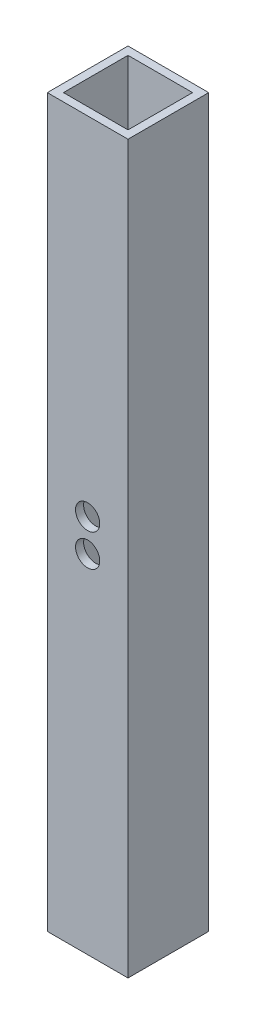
ISO-10303-21;
HEADER;
FILE_DESCRIPTION(('STEP AP214'),'2;1');
FILE_NAME('part.step','',(''),(''),'','','');
FILE_SCHEMA(('AUTOMOTIVE_DESIGN { 1 0 10303 214 1 1 1 1 }'));
ENDSEC;
DATA;
#1=APPLICATION_CONTEXT('core data for automotive mechanical design processes');
#2=APPLICATION_PROTOCOL_DEFINITION('international standard','automotive_design',2000,#1);
#3=PRODUCT_CONTEXT('',#1,'mechanical');
#4=PRODUCT('Part','Part','',(#3));
#5=PRODUCT_RELATED_PRODUCT_CATEGORY('part','',(#4));
#6=PRODUCT_DEFINITION_FORMATION('','',#4);
#7=PRODUCT_DEFINITION_CONTEXT('part definition',#1,'design');
#8=PRODUCT_DEFINITION('design','',#6,#7);
#9=PRODUCT_DEFINITION_SHAPE('','',#8);
#10=(LENGTH_UNIT() NAMED_UNIT(*) SI_UNIT(.MILLI.,.METRE.));
#11=(NAMED_UNIT(*) PLANE_ANGLE_UNIT() SI_UNIT($,.RADIAN.));
#12=(NAMED_UNIT(*) SI_UNIT($,.STERADIAN.) SOLID_ANGLE_UNIT());
#13=UNCERTAINTY_MEASURE_WITH_UNIT(LENGTH_MEASURE(1.E-05),#10,'distance_accuracy_value','');
#14=(GEOMETRIC_REPRESENTATION_CONTEXT(3) GLOBAL_UNCERTAINTY_ASSIGNED_CONTEXT((#13)) GLOBAL_UNIT_ASSIGNED_CONTEXT((#10,
#11,#12)) REPRESENTATION_CONTEXT('',''));
#15=CARTESIAN_POINT('',(0.,0.,0.));
#16=DIRECTION('',(0.,0.,1.));
#17=DIRECTION('',(1.,0.,0.));
#18=AXIS2_PLACEMENT_3D('',#15,#16,#17);
#19=CARTESIAN_POINT('',(0.,90.,0.));
#20=DIRECTION('',(0.,-1.,0.));
#21=DIRECTION('',(0.,0.,-1.));
#22=AXIS2_PLACEMENT_3D('',#19,#20,#21);
#23=PLANE('',#22);
#24=DIRECTION('',(0.,0.,1.));
#25=VECTOR('',#24,1.);
#26=CARTESIAN_POINT('',(0.,90.,0.));
#27=LINE('',#26,#25);
#28=CARTESIAN_POINT('',(0.,90.,-10.));
#29=VERTEX_POINT('',#28);
#30=CARTESIAN_POINT('',(0.,90.,0.));
#31=VERTEX_POINT('',#30);
#32=EDGE_CURVE('E138',#29,#31,#27,.T.);
#33=ORIENTED_EDGE('',*,*,#32,.T.);
#34=DIRECTION('',(1.,0.,0.));
#35=VECTOR('',#34,1.);
#36=CARTESIAN_POINT('',(0.,90.,0.));
#37=LINE('',#36,#35);
#38=CARTESIAN_POINT('',(10.,90.,0.));
#39=VERTEX_POINT('',#38);
#40=EDGE_CURVE('E141',#31,#39,#37,.T.);
#41=ORIENTED_EDGE('',*,*,#40,.T.);
#42=DIRECTION('',(0.,0.,-1.));
#43=VECTOR('',#42,1.);
#44=CARTESIAN_POINT('',(10.,90.,0.));
#45=LINE('',#44,#43);
#46=CARTESIAN_POINT('',(10.,90.,-10.));
#47=VERTEX_POINT('',#46);
#48=EDGE_CURVE('E144',#39,#47,#45,.T.);
#49=ORIENTED_EDGE('',*,*,#48,.T.);
#50=DIRECTION('',(-1.,0.,0.));
#51=VECTOR('',#50,1.);
#52=CARTESIAN_POINT('',(0.,90.,-10.));
#53=LINE('',#52,#51);
#54=EDGE_CURVE('E146',#47,#29,#53,.T.);
#55=ORIENTED_EDGE('',*,*,#54,.T.);
#56=EDGE_LOOP('',(#33,#41,#49,#55));
#57=FACE_BOUND('',#56,.T.);
#58=DIRECTION('',(0.,0.,1.));
#59=VECTOR('',#58,1.);
#60=CARTESIAN_POINT('',(1.,90.,-1.));
#61=LINE('',#60,#59);
#62=CARTESIAN_POINT('',(1.,90.,-9.));
#63=VERTEX_POINT('',#62);
#64=CARTESIAN_POINT('',(1.,90.,-1.));
#65=VERTEX_POINT('',#64);
#66=EDGE_CURVE('E100',#63,#65,#61,.T.);
#67=ORIENTED_EDGE('',*,*,#66,.F.);
#68=DIRECTION('',(-1.,0.,0.));
#69=VECTOR('',#68,1.);
#70=CARTESIAN_POINT('',(1.,90.,-9.));
#71=LINE('',#70,#69);
#72=CARTESIAN_POINT('',(9.,90.,-9.));
#73=VERTEX_POINT('',#72);
#74=EDGE_CURVE('E122',#73,#63,#71,.T.);
#75=ORIENTED_EDGE('',*,*,#74,.F.);
#76=DIRECTION('',(0.,0.,-1.));
#77=VECTOR('',#76,1.);
#78=CARTESIAN_POINT('',(9.,90.,-1.));
#79=LINE('',#78,#77);
#80=CARTESIAN_POINT('',(9.,90.,-1.));
#81=VERTEX_POINT('',#80);
#82=EDGE_CURVE('E120',#81,#73,#79,.T.);
#83=ORIENTED_EDGE('',*,*,#82,.F.);
#84=DIRECTION('',(1.,0.,0.));
#85=VECTOR('',#84,1.);
#86=CARTESIAN_POINT('',(1.,90.,-1.));
#87=LINE('',#86,#85);
#88=EDGE_CURVE('E108',#65,#81,#87,.T.);
#89=ORIENTED_EDGE('',*,*,#88,.F.);
#90=EDGE_LOOP('',(#67,#75,#83,#89));
#91=FACE_BOUND('',#90,.T.);
#92=ADVANCED_FACE('F33',(#57,#91),#23,.F.);
#93=CARTESIAN_POINT('',(0.,0.,0.));
#94=DIRECTION('',(0.,-1.,0.));
#95=DIRECTION('',(0.,0.,-1.));
#96=AXIS2_PLACEMENT_3D('',#93,#94,#95);
#97=PLANE('',#96);
#98=DIRECTION('',(0.,0.,1.));
#99=VECTOR('',#98,1.);
#100=CARTESIAN_POINT('',(0.,0.,0.));
#101=LINE('',#100,#99);
#102=CARTESIAN_POINT('',(0.,0.,-10.));
#103=VERTEX_POINT('',#102);
#104=CARTESIAN_POINT('',(0.,0.,0.));
#105=VERTEX_POINT('',#104);
#106=EDGE_CURVE('E116',#103,#105,#101,.T.);
#107=ORIENTED_EDGE('',*,*,#106,.F.);
#108=DIRECTION('',(-1.,0.,0.));
#109=VECTOR('',#108,1.);
#110=CARTESIAN_POINT('',(0.,0.,-10.));
#111=LINE('',#110,#109);
#112=CARTESIAN_POINT('',(10.,0.,-10.));
#113=VERTEX_POINT('',#112);
#114=EDGE_CURVE('E142',#113,#103,#111,.T.);
#115=ORIENTED_EDGE('',*,*,#114,.F.);
#116=DIRECTION('',(0.,0.,-1.));
#117=VECTOR('',#116,1.);
#118=CARTESIAN_POINT('',(10.,0.,0.));
#119=LINE('',#118,#117);
#120=CARTESIAN_POINT('',(10.,0.,0.));
#121=VERTEX_POINT('',#120);
#122=EDGE_CURVE('E153',#121,#113,#119,.T.);
#123=ORIENTED_EDGE('',*,*,#122,.F.);
#124=DIRECTION('',(1.,0.,0.));
#125=VECTOR('',#124,1.);
#126=CARTESIAN_POINT('',(0.,0.,0.));
#127=LINE('',#126,#125);
#128=EDGE_CURVE('E151',#105,#121,#127,.T.);
#129=ORIENTED_EDGE('',*,*,#128,.F.);
#130=EDGE_LOOP('',(#107,#115,#123,#129));
#131=FACE_BOUND('',#130,.T.);
#132=DIRECTION('',(-1.,0.,0.));
#133=VECTOR('',#132,1.);
#134=CARTESIAN_POINT('',(1.,0.,-9.));
#135=LINE('',#134,#133);
#136=CARTESIAN_POINT('',(9.,0.,-9.));
#137=VERTEX_POINT('',#136);
#138=CARTESIAN_POINT('',(1.,0.,-9.));
#139=VERTEX_POINT('',#138);
#140=EDGE_CURVE('E109',#137,#139,#135,.T.);
#141=ORIENTED_EDGE('',*,*,#140,.T.);
#142=DIRECTION('',(0.,0.,1.));
#143=VECTOR('',#142,1.);
#144=CARTESIAN_POINT('',(1.,0.,-1.));
#145=LINE('',#144,#143);
#146=CARTESIAN_POINT('',(1.,0.,-1.));
#147=VERTEX_POINT('',#146);
#148=EDGE_CURVE('E58',#139,#147,#145,.T.);
#149=ORIENTED_EDGE('',*,*,#148,.T.);
#150=DIRECTION('',(1.,0.,0.));
#151=VECTOR('',#150,1.);
#152=CARTESIAN_POINT('',(1.,0.,-1.));
#153=LINE('',#152,#151);
#154=CARTESIAN_POINT('',(9.,0.,-1.));
#155=VERTEX_POINT('',#154);
#156=EDGE_CURVE('E115',#147,#155,#153,.T.);
#157=ORIENTED_EDGE('',*,*,#156,.T.);
#158=DIRECTION('',(0.,0.,-1.));
#159=VECTOR('',#158,1.);
#160=CARTESIAN_POINT('',(9.,0.,-1.));
#161=LINE('',#160,#159);
#162=EDGE_CURVE('E130',#155,#137,#161,.T.);
#163=ORIENTED_EDGE('',*,*,#162,.T.);
#164=EDGE_LOOP('',(#141,#149,#157,#163));
#165=FACE_BOUND('',#164,.T.);
#166=ADVANCED_FACE('F203',(#131,#165),#97,.T.);
#167=CARTESIAN_POINT('',(0.,90.,0.));
#168=DIRECTION('',(1.,0.,0.));
#169=DIRECTION('',(0.,0.,-1.));
#170=AXIS2_PLACEMENT_3D('',#167,#168,#169);
#171=PLANE('',#170);
#172=ORIENTED_EDGE('',*,*,#106,.T.);
#173=DIRECTION('',(0.,-1.,0.));
#174=VECTOR('',#173,1.);
#175=CARTESIAN_POINT('',(0.,90.,0.));
#176=LINE('',#175,#174);
#177=EDGE_CURVE('E11',#31,#105,#176,.T.);
#178=ORIENTED_EDGE('',*,*,#177,.F.);
#179=ORIENTED_EDGE('',*,*,#32,.F.);
#180=DIRECTION('',(0.,-1.,0.));
#181=VECTOR('',#180,1.);
#182=CARTESIAN_POINT('',(0.,90.,-10.));
#183=LINE('',#182,#181);
#184=EDGE_CURVE('E148',#29,#103,#183,.T.);
#185=ORIENTED_EDGE('',*,*,#184,.T.);
#186=EDGE_LOOP('',(#172,#178,#179,#185));
#187=FACE_BOUND('',#186,.T.);
#188=ADVANCED_FACE('F35',(#187),#171,.F.);
#189=CARTESIAN_POINT('',(0.,90.,0.));
#190=DIRECTION('',(0.,0.,-1.));
#191=DIRECTION('',(-1.,0.,0.));
#192=AXIS2_PLACEMENT_3D('',#189,#190,#191);
#193=PLANE('',#192);
#194=CARTESIAN_POINT('',(5.,43.,0.));
#195=DIRECTION('',(0.,0.,1.));
#196=DIRECTION('',(1.,0.,0.));
#197=AXIS2_PLACEMENT_3D('',#194,#195,#196);
#198=CIRCLE('',#197,1.5);
#199=CARTESIAN_POINT('',(6.5,43.,0.));
#200=VERTEX_POINT('',#199);
#201=EDGE_CURVE('E182',#200,#200,#198,.T.);
#202=ORIENTED_EDGE('',*,*,#201,.F.);
#203=EDGE_LOOP('',(#202));
#204=FACE_BOUND('',#203,.T.);
#205=CARTESIAN_POINT('',(5.,47.,0.));
#206=DIRECTION('',(0.,0.,1.));
#207=DIRECTION('',(1.,0.,0.));
#208=AXIS2_PLACEMENT_3D('',#205,#206,#207);
#209=CIRCLE('',#208,1.5);
#210=CARTESIAN_POINT('',(6.5,47.,0.));
#211=VERTEX_POINT('',#210);
#212=EDGE_CURVE('E169',#211,#211,#209,.T.);
#213=ORIENTED_EDGE('',*,*,#212,.F.);
#214=EDGE_LOOP('',(#213));
#215=FACE_BOUND('',#214,.T.);
#216=ORIENTED_EDGE('',*,*,#128,.T.);
#217=DIRECTION('',(0.,-1.,0.));
#218=VECTOR('',#217,1.);
#219=CARTESIAN_POINT('',(10.,90.,0.));
#220=LINE('',#219,#218);
#221=EDGE_CURVE('E42',#39,#121,#220,.T.);
#222=ORIENTED_EDGE('',*,*,#221,.F.);
#223=ORIENTED_EDGE('',*,*,#40,.F.);
#224=ORIENTED_EDGE('',*,*,#177,.T.);
#225=EDGE_LOOP('',(#216,#222,#223,#224));
#226=FACE_BOUND('',#225,.T.);
#227=ADVANCED_FACE('F188',(#204,#215,#226),#193,.F.);
#228=CARTESIAN_POINT('',(10.,90.,0.));
#229=DIRECTION('',(-1.,0.,0.));
#230=DIRECTION('',(0.,0.,1.));
#231=AXIS2_PLACEMENT_3D('',#228,#229,#230);
#232=PLANE('',#231);
#233=ORIENTED_EDGE('',*,*,#122,.T.);
#234=DIRECTION('',(0.,-1.,0.));
#235=VECTOR('',#234,1.);
#236=CARTESIAN_POINT('',(10.,90.,-10.));
#237=LINE('',#236,#235);
#238=EDGE_CURVE('E158',#47,#113,#237,.T.);
#239=ORIENTED_EDGE('',*,*,#238,.F.);
#240=ORIENTED_EDGE('',*,*,#48,.F.);
#241=ORIENTED_EDGE('',*,*,#221,.T.);
#242=EDGE_LOOP('',(#233,#239,#240,#241));
#243=FACE_BOUND('',#242,.T.);
#244=ADVANCED_FACE('F191',(#243),#232,.F.);
#245=CARTESIAN_POINT('',(0.,90.,-10.));
#246=DIRECTION('',(0.,0.,1.));
#247=DIRECTION('',(1.,0.,0.));
#248=AXIS2_PLACEMENT_3D('',#245,#246,#247);
#249=PLANE('',#248);
#250=CARTESIAN_POINT('',(5.,43.,-10.));
#251=DIRECTION('',(0.,0.,1.));
#252=DIRECTION('',(1.,0.,0.));
#253=AXIS2_PLACEMENT_3D('',#250,#251,#252);
#254=CIRCLE('',#253,1.5);
#255=CARTESIAN_POINT('',(6.5,43.,-10.));
#256=VERTEX_POINT('',#255);
#257=EDGE_CURVE('E179',#256,#256,#254,.F.);
#258=ORIENTED_EDGE('',*,*,#257,.F.);
#259=EDGE_LOOP('',(#258));
#260=FACE_BOUND('',#259,.T.);
#261=CARTESIAN_POINT('',(5.,47.,-10.));
#262=DIRECTION('',(0.,0.,1.));
#263=DIRECTION('',(1.,0.,0.));
#264=AXIS2_PLACEMENT_3D('',#261,#262,#263);
#265=CIRCLE('',#264,1.5);
#266=CARTESIAN_POINT('',(6.5,47.,-10.));
#267=VERTEX_POINT('',#266);
#268=EDGE_CURVE('E164',#267,#267,#265,.F.);
#269=ORIENTED_EDGE('',*,*,#268,.F.);
#270=EDGE_LOOP('',(#269));
#271=FACE_BOUND('',#270,.T.);
#272=ORIENTED_EDGE('',*,*,#114,.T.);
#273=ORIENTED_EDGE('',*,*,#184,.F.);
#274=ORIENTED_EDGE('',*,*,#54,.F.);
#275=ORIENTED_EDGE('',*,*,#238,.T.);
#276=EDGE_LOOP('',(#272,#273,#274,#275));
#277=FACE_BOUND('',#276,.T.);
#278=ADVANCED_FACE('F207',(#260,#271,#277),#249,.F.);
#279=CARTESIAN_POINT('',(1.,90.,-1.));
#280=DIRECTION('',(1.,0.,0.));
#281=DIRECTION('',(0.,0.,-1.));
#282=AXIS2_PLACEMENT_3D('',#279,#280,#281);
#283=PLANE('',#282);
#284=ORIENTED_EDGE('',*,*,#148,.F.);
#285=DIRECTION('',(0.,-1.,0.));
#286=VECTOR('',#285,1.);
#287=CARTESIAN_POINT('',(1.,90.,-9.));
#288=LINE('',#287,#286);
#289=EDGE_CURVE('E104',#63,#139,#288,.T.);
#290=ORIENTED_EDGE('',*,*,#289,.F.);
#291=ORIENTED_EDGE('',*,*,#66,.T.);
#292=DIRECTION('',(0.,-1.,0.));
#293=VECTOR('',#292,1.);
#294=CARTESIAN_POINT('',(1.,90.,-1.));
#295=LINE('',#294,#293);
#296=EDGE_CURVE('E103',#65,#147,#295,.T.);
#297=ORIENTED_EDGE('',*,*,#296,.T.);
#298=EDGE_LOOP('',(#284,#290,#291,#297));
#299=FACE_BOUND('',#298,.T.);
#300=ADVANCED_FACE('F102',(#299),#283,.T.);
#301=CARTESIAN_POINT('',(1.,90.,-1.));
#302=DIRECTION('',(0.,0.,-1.));
#303=DIRECTION('',(-1.,0.,0.));
#304=AXIS2_PLACEMENT_3D('',#301,#302,#303);
#305=PLANE('',#304);
#306=CARTESIAN_POINT('',(5.,43.,-0.999999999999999));
#307=DIRECTION('',(0.,0.,-1.));
#308=DIRECTION('',(-1.,0.,0.));
#309=AXIS2_PLACEMENT_3D('',#306,#307,#308);
#310=CIRCLE('',#309,1.5);
#311=CARTESIAN_POINT('',(6.5,43.,-0.999999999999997));
#312=VERTEX_POINT('',#311);
#313=EDGE_CURVE('E174',#312,#312,#310,.T.);
#314=ORIENTED_EDGE('',*,*,#313,.F.);
#315=EDGE_LOOP('',(#314));
#316=FACE_BOUND('',#315,.T.);
#317=CARTESIAN_POINT('',(5.,47.,-0.999999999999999));
#318=DIRECTION('',(0.,0.,-1.));
#319=DIRECTION('',(-1.,0.,0.));
#320=AXIS2_PLACEMENT_3D('',#317,#318,#319);
#321=CIRCLE('',#320,1.5);
#322=CARTESIAN_POINT('',(6.5,47.,-0.999999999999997));
#323=VERTEX_POINT('',#322);
#324=EDGE_CURVE('E128',#323,#323,#321,.T.);
#325=ORIENTED_EDGE('',*,*,#324,.F.);
#326=EDGE_LOOP('',(#325));
#327=FACE_BOUND('',#326,.T.);
#328=ORIENTED_EDGE('',*,*,#156,.F.);
#329=ORIENTED_EDGE('',*,*,#296,.F.);
#330=ORIENTED_EDGE('',*,*,#88,.T.);
#331=DIRECTION('',(0.,-1.,0.));
#332=VECTOR('',#331,1.);
#333=CARTESIAN_POINT('',(9.,90.,-1.));
#334=LINE('',#333,#332);
#335=EDGE_CURVE('E117',#81,#155,#334,.T.);
#336=ORIENTED_EDGE('',*,*,#335,.T.);
#337=EDGE_LOOP('',(#328,#329,#330,#336));
#338=FACE_BOUND('',#337,.T.);
#339=ADVANCED_FACE('F112',(#316,#327,#338),#305,.T.);
#340=CARTESIAN_POINT('',(9.,90.,-1.));
#341=DIRECTION('',(-1.,0.,0.));
#342=DIRECTION('',(0.,0.,1.));
#343=AXIS2_PLACEMENT_3D('',#340,#341,#342);
#344=PLANE('',#343);
#345=ORIENTED_EDGE('',*,*,#162,.F.);
#346=ORIENTED_EDGE('',*,*,#335,.F.);
#347=ORIENTED_EDGE('',*,*,#82,.T.);
#348=DIRECTION('',(0.,-1.,0.));
#349=VECTOR('',#348,1.);
#350=CARTESIAN_POINT('',(9.,90.,-9.));
#351=LINE('',#350,#349);
#352=EDGE_CURVE('E50',#73,#137,#351,.T.);
#353=ORIENTED_EDGE('',*,*,#352,.T.);
#354=EDGE_LOOP('',(#345,#346,#347,#353));
#355=FACE_BOUND('',#354,.T.);
#356=ADVANCED_FACE('F251',(#355),#344,.T.);
#357=CARTESIAN_POINT('',(1.,90.,-9.));
#358=DIRECTION('',(0.,0.,1.));
#359=DIRECTION('',(1.,0.,0.));
#360=AXIS2_PLACEMENT_3D('',#357,#358,#359);
#361=PLANE('',#360);
#362=CARTESIAN_POINT('',(5.,43.,-9.));
#363=DIRECTION('',(0.,0.,1.));
#364=DIRECTION('',(1.,0.,0.));
#365=AXIS2_PLACEMENT_3D('',#362,#363,#364);
#366=CIRCLE('',#365,1.5);
#367=CARTESIAN_POINT('',(6.5,43.,-9.));
#368=VERTEX_POINT('',#367);
#369=EDGE_CURVE('E37',#368,#368,#366,.T.);
#370=ORIENTED_EDGE('',*,*,#369,.F.);
#371=EDGE_LOOP('',(#370));
#372=FACE_BOUND('',#371,.T.);
#373=CARTESIAN_POINT('',(5.,47.,-9.));
#374=DIRECTION('',(0.,0.,1.));
#375=DIRECTION('',(1.,0.,0.));
#376=AXIS2_PLACEMENT_3D('',#373,#374,#375);
#377=CIRCLE('',#376,1.5);
#378=CARTESIAN_POINT('',(6.5,47.,-9.));
#379=VERTEX_POINT('',#378);
#380=EDGE_CURVE('E162',#379,#379,#377,.T.);
#381=ORIENTED_EDGE('',*,*,#380,.F.);
#382=EDGE_LOOP('',(#381));
#383=FACE_BOUND('',#382,.T.);
#384=ORIENTED_EDGE('',*,*,#140,.F.);
#385=ORIENTED_EDGE('',*,*,#352,.F.);
#386=ORIENTED_EDGE('',*,*,#74,.T.);
#387=ORIENTED_EDGE('',*,*,#289,.T.);
#388=EDGE_LOOP('',(#384,#385,#386,#387));
#389=FACE_BOUND('',#388,.T.);
#390=ADVANCED_FACE('F260',(#372,#383,#389),#361,.T.);
#391=CARTESIAN_POINT('',(5.,47.,-14.2426406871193));
#392=DIRECTION('',(0.,0.,1.));
#393=DIRECTION('',(1.,0.,0.));
#394=AXIS2_PLACEMENT_3D('',#391,#392,#393);
#395=CYLINDRICAL_SURFACE('',#394,1.5);
#396=CARTESIAN_POINT('',(6.5,47.,-9.));
#397=CARTESIAN_POINT('',(6.5,47.,-9.01041666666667));
#398=CARTESIAN_POINT('',(6.5,47.,-9.02083333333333));
#399=CARTESIAN_POINT('',(6.5,47.,-9.04166666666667));
#400=CARTESIAN_POINT('',(6.5,47.,-9.05208333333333));
#401=CARTESIAN_POINT('',(6.5,47.,-9.07291666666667));
#402=CARTESIAN_POINT('',(6.5,47.,-9.08333333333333));
#403=CARTESIAN_POINT('',(6.5,47.,-9.10416666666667));
#404=CARTESIAN_POINT('',(6.5,47.,-9.11458333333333));
#405=CARTESIAN_POINT('',(6.5,47.,-9.13541666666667));
#406=CARTESIAN_POINT('',(6.5,47.,-9.14583333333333));
#407=CARTESIAN_POINT('',(6.5,47.,-9.16666666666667));
#408=CARTESIAN_POINT('',(6.5,47.,-9.17708333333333));
#409=CARTESIAN_POINT('',(6.5,47.,-9.19791666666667));
#410=CARTESIAN_POINT('',(6.5,47.,-9.20833333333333));
#411=CARTESIAN_POINT('',(6.5,47.,-9.22916666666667));
#412=CARTESIAN_POINT('',(6.5,47.,-9.23958333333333));
#413=CARTESIAN_POINT('',(6.5,47.,-9.26041666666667));
#414=CARTESIAN_POINT('',(6.5,47.,-9.27083333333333));
#415=CARTESIAN_POINT('',(6.5,47.,-9.29166666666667));
#416=CARTESIAN_POINT('',(6.5,47.,-9.30208333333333));
#417=CARTESIAN_POINT('',(6.5,47.,-9.32291666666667));
#418=CARTESIAN_POINT('',(6.5,47.,-9.33333333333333));
#419=CARTESIAN_POINT('',(6.5,47.,-9.35416666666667));
#420=CARTESIAN_POINT('',(6.5,47.,-9.36458333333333));
#421=CARTESIAN_POINT('',(6.5,47.,-9.38541666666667));
#422=CARTESIAN_POINT('',(6.5,47.,-9.39583333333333));
#423=CARTESIAN_POINT('',(6.5,47.,-9.41666666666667));
#424=CARTESIAN_POINT('',(6.5,47.,-9.42708333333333));
#425=CARTESIAN_POINT('',(6.5,47.,-9.44791666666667));
#426=CARTESIAN_POINT('',(6.5,47.,-9.45833333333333));
#427=CARTESIAN_POINT('',(6.5,47.,-9.47916666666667));
#428=CARTESIAN_POINT('',(6.5,47.,-9.48958333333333));
#429=CARTESIAN_POINT('',(6.5,47.,-9.51041666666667));
#430=CARTESIAN_POINT('',(6.5,47.,-9.52083333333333));
#431=CARTESIAN_POINT('',(6.5,47.,-9.54166666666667));
#432=CARTESIAN_POINT('',(6.5,47.,-9.55208333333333));
#433=CARTESIAN_POINT('',(6.5,47.,-9.57291666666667));
#434=CARTESIAN_POINT('',(6.5,47.,-9.58333333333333));
#435=CARTESIAN_POINT('',(6.5,47.,-9.60416666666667));
#436=CARTESIAN_POINT('',(6.5,47.,-9.61458333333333));
#437=CARTESIAN_POINT('',(6.5,47.,-9.63541666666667));
#438=CARTESIAN_POINT('',(6.5,47.,-9.64583333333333));
#439=CARTESIAN_POINT('',(6.5,47.,-9.66666666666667));
#440=CARTESIAN_POINT('',(6.5,47.,-9.67708333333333));
#441=CARTESIAN_POINT('',(6.5,47.,-9.69791666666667));
#442=CARTESIAN_POINT('',(6.5,47.,-9.70833333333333));
#443=CARTESIAN_POINT('',(6.5,47.,-9.72916666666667));
#444=CARTESIAN_POINT('',(6.5,47.,-9.73958333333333));
#445=CARTESIAN_POINT('',(6.5,47.,-9.76041666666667));
#446=CARTESIAN_POINT('',(6.5,47.,-9.77083333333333));
#447=CARTESIAN_POINT('',(6.5,47.,-9.79166666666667));
#448=CARTESIAN_POINT('',(6.5,47.,-9.80208333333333));
#449=CARTESIAN_POINT('',(6.5,47.,-9.82291666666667));
#450=CARTESIAN_POINT('',(6.5,47.,-9.83333333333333));
#451=CARTESIAN_POINT('',(6.5,47.,-9.85416666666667));
#452=CARTESIAN_POINT('',(6.5,47.,-9.86458333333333));
#453=CARTESIAN_POINT('',(6.5,47.,-9.88541666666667));
#454=CARTESIAN_POINT('',(6.5,47.,-9.89583333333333));
#455=CARTESIAN_POINT('',(6.5,47.,-9.91666666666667));
#456=CARTESIAN_POINT('',(6.5,47.,-9.92708333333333));
#457=CARTESIAN_POINT('',(6.5,47.,-9.94791666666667));
#458=CARTESIAN_POINT('',(6.5,47.,-9.95833333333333));
#459=CARTESIAN_POINT('',(6.5,47.,-9.97916666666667));
#460=CARTESIAN_POINT('',(6.5,47.,-9.98958333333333));
#461=CARTESIAN_POINT('',(6.5,47.,-10.));
#462=B_SPLINE_CURVE_WITH_KNOTS('',3,(#396,#397,#398,#399,#400,#401,#402,#403,#404,#405,#406,
#407,#408,#409,#410,#411,#412,#413,#414,#415,#416,#417,#418,#419,#420,#421,#422,#423,#424,#425,
#426,#427,#428,#429,#430,#431,#432,#433,#434,#435,#436,#437,#438,#439,#440,#441,#442,#443,#444,
#445,#446,#447,#448,#449,#450,#451,#452,#453,#454,#455,#456,#457,#458,#459,#460,#461),
.UNSPECIFIED.,.F.,.F.,(4,2,2,2,2,2,2,2,2,2,2,2,2,2,2,2,2,2,2,2,2,2,2,2,2,2,2,2,2,2,2,2,4),(0.,
0.03125,0.0625000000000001,0.0937500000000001,0.125,0.15625,0.1875,0.21875,0.25,0.28125,0.3125,
0.34375,0.375,0.40625,0.4375,0.46875,0.5,0.53125,0.5625,0.593750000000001,0.625000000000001,
0.656250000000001,0.687500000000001,0.718750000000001,0.750000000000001,0.781250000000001,
0.812500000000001,0.843750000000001,0.875000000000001,0.906250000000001,0.937500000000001,
0.968750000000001,1.),.UNSPECIFIED.);
#463=EDGE_CURVE('BSEAM267',#379,#267,#462,.T.);
#464=ORIENTED_EDGE('',*,*,#380,.T.);
#465=ORIENTED_EDGE('',*,*,#268,.T.);
#466=ORIENTED_EDGE('',*,*,#463,.T.);
#467=ORIENTED_EDGE('',*,*,#463,.F.);
#468=EDGE_LOOP('',(#464,#466,#465,#467));
#469=FACE_BOUND('',#468,.T.);
#470=ADVANCED_FACE('F267',(#469),#395,.F.);
#471=CARTESIAN_POINT('',(6.5,47.,-0.999999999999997));
#472=CARTESIAN_POINT('',(6.5,47.,-0.989583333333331));
#473=CARTESIAN_POINT('',(6.5,47.,-0.979166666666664));
#474=CARTESIAN_POINT('',(6.5,47.,-0.958333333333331));
#475=CARTESIAN_POINT('',(6.5,47.,-0.947916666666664));
#476=CARTESIAN_POINT('',(6.5,47.,-0.927083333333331));
#477=CARTESIAN_POINT('',(6.5,47.,-0.916666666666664));
#478=CARTESIAN_POINT('',(6.5,47.,-0.895833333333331));
#479=CARTESIAN_POINT('',(6.5,47.,-0.885416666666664));
#480=CARTESIAN_POINT('',(6.5,47.,-0.864583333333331));
#481=CARTESIAN_POINT('',(6.5,47.,-0.854166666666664));
#482=CARTESIAN_POINT('',(6.5,47.,-0.833333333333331));
#483=CARTESIAN_POINT('',(6.5,47.,-0.822916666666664));
#484=CARTESIAN_POINT('',(6.5,47.,-0.802083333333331));
#485=CARTESIAN_POINT('',(6.5,47.,-0.791666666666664));
#486=CARTESIAN_POINT('',(6.5,47.,-0.77083333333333));
#487=CARTESIAN_POINT('',(6.5,47.,-0.760416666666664));
#488=CARTESIAN_POINT('',(6.5,47.,-0.739583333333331));
#489=CARTESIAN_POINT('',(6.5,47.,-0.729166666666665));
#490=CARTESIAN_POINT('',(6.5,47.,-0.708333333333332));
#491=CARTESIAN_POINT('',(6.5,47.,-0.697916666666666));
#492=CARTESIAN_POINT('',(6.5,47.,-0.677083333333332));
#493=CARTESIAN_POINT('',(6.5,47.,-0.666666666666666));
#494=CARTESIAN_POINT('',(6.5,47.,-0.645833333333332));
#495=CARTESIAN_POINT('',(6.5,47.,-0.635416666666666));
#496=CARTESIAN_POINT('',(6.5,47.,-0.614583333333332));
#497=CARTESIAN_POINT('',(6.5,47.,-0.604166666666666));
#498=CARTESIAN_POINT('',(6.5,47.,-0.583333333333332));
#499=CARTESIAN_POINT('',(6.5,47.,-0.572916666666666));
#500=CARTESIAN_POINT('',(6.5,47.,-0.552083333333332));
#501=CARTESIAN_POINT('',(6.5,47.,-0.541666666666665));
#502=CARTESIAN_POINT('',(6.5,47.,-0.520833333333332));
#503=CARTESIAN_POINT('',(6.5,47.,-0.510416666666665));
#504=CARTESIAN_POINT('',(6.5,47.,-0.489583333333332));
#505=CARTESIAN_POINT('',(6.5,47.,-0.479166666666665));
#506=CARTESIAN_POINT('',(6.5,47.,-0.458333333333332));
#507=CARTESIAN_POINT('',(6.5,47.,-0.447916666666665));
#508=CARTESIAN_POINT('',(6.5,47.,-0.427083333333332));
#509=CARTESIAN_POINT('',(6.5,47.,-0.416666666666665));
#510=CARTESIAN_POINT('',(6.5,47.,-0.395833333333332));
#511=CARTESIAN_POINT('',(6.5,47.,-0.385416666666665));
#512=CARTESIAN_POINT('',(6.5,47.,-0.364583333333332));
#513=CARTESIAN_POINT('',(6.5,47.,-0.354166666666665));
#514=CARTESIAN_POINT('',(6.5,47.,-0.333333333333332));
#515=CARTESIAN_POINT('',(6.5,47.,-0.322916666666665));
#516=CARTESIAN_POINT('',(6.5,47.,-0.302083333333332));
#517=CARTESIAN_POINT('',(6.5,47.,-0.291666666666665));
#518=CARTESIAN_POINT('',(6.5,47.,-0.270833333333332));
#519=CARTESIAN_POINT('',(6.5,47.,-0.260416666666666));
#520=CARTESIAN_POINT('',(6.5,47.,-0.239583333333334));
#521=CARTESIAN_POINT('',(6.5,47.,-0.229166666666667));
#522=CARTESIAN_POINT('',(6.5,47.,-0.208333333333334));
#523=CARTESIAN_POINT('',(6.5,47.,-0.197916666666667));
#524=CARTESIAN_POINT('',(6.5,47.,-0.177083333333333));
#525=CARTESIAN_POINT('',(6.5,47.,-0.166666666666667));
#526=CARTESIAN_POINT('',(6.5,47.,-0.145833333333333));
#527=CARTESIAN_POINT('',(6.5,47.,-0.135416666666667));
#528=CARTESIAN_POINT('',(6.5,47.,-0.114583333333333));
#529=CARTESIAN_POINT('',(6.5,47.,-0.104166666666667));
#530=CARTESIAN_POINT('',(6.5,47.,-0.0833333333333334));
#531=CARTESIAN_POINT('',(6.5,47.,-0.0729166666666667));
#532=CARTESIAN_POINT('',(6.5,47.,-0.0520833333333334));
#533=CARTESIAN_POINT('',(6.5,47.,-0.0416666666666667));
#534=CARTESIAN_POINT('',(6.5,47.,-0.0208333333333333));
#535=CARTESIAN_POINT('',(6.5,47.,-0.0104166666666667));
#536=CARTESIAN_POINT('',(6.5,47.,0.));
#537=B_SPLINE_CURVE_WITH_KNOTS('',3,(#471,#472,#473,#474,#475,#476,#477,#478,#479,#480,#481,
#482,#483,#484,#485,#486,#487,#488,#489,#490,#491,#492,#493,#494,#495,#496,#497,#498,#499,#500,
#501,#502,#503,#504,#505,#506,#507,#508,#509,#510,#511,#512,#513,#514,#515,#516,#517,#518,#519,
#520,#521,#522,#523,#524,#525,#526,#527,#528,#529,#530,#531,#532,#533,#534,#535,#536),
.UNSPECIFIED.,.F.,.F.,(4,2,2,2,2,2,2,2,2,2,2,2,2,2,2,2,2,2,2,2,2,2,2,2,2,2,2,2,2,2,2,2,4),(0.,
0.03125,0.0625000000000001,0.0937500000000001,0.125,0.15625,0.1875,0.21875,0.25,
0.281249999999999,0.312499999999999,0.343749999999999,0.374999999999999,0.406249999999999,
0.437499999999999,0.468749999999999,0.499999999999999,0.531249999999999,0.562499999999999,
0.593749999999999,0.624999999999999,0.656249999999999,0.687499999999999,0.718749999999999,
0.749999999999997,0.781249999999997,0.812499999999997,0.843749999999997,0.874999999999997,
0.906249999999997,0.937499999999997,0.968749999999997,0.999999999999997),.UNSPECIFIED.);
#538=EDGE_CURVE('BSEAM277',#323,#211,#537,.T.);
#539=ORIENTED_EDGE('',*,*,#324,.T.);
#540=ORIENTED_EDGE('',*,*,#212,.T.);
#541=ORIENTED_EDGE('',*,*,#538,.T.);
#542=ORIENTED_EDGE('',*,*,#538,.F.);
#543=EDGE_LOOP('',(#539,#541,#540,#542));
#544=FACE_BOUND('',#543,.T.);
#545=ADVANCED_FACE('F277',(#544),#395,.F.);
#546=CARTESIAN_POINT('',(5.,43.,-14.2426406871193));
#547=DIRECTION('',(0.,0.,1.));
#548=DIRECTION('',(1.,0.,0.));
#549=AXIS2_PLACEMENT_3D('',#546,#547,#548);
#550=CYLINDRICAL_SURFACE('',#549,1.5);
#551=CARTESIAN_POINT('',(6.5,43.,-9.));
#552=CARTESIAN_POINT('',(6.5,43.,-9.01041666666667));
#553=CARTESIAN_POINT('',(6.5,43.,-9.02083333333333));
#554=CARTESIAN_POINT('',(6.5,43.,-9.04166666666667));
#555=CARTESIAN_POINT('',(6.5,43.,-9.05208333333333));
#556=CARTESIAN_POINT('',(6.5,43.,-9.07291666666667));
#557=CARTESIAN_POINT('',(6.5,43.,-9.08333333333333));
#558=CARTESIAN_POINT('',(6.5,43.,-9.10416666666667));
#559=CARTESIAN_POINT('',(6.5,43.,-9.11458333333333));
#560=CARTESIAN_POINT('',(6.5,43.,-9.13541666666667));
#561=CARTESIAN_POINT('',(6.5,43.,-9.14583333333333));
#562=CARTESIAN_POINT('',(6.5,43.,-9.16666666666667));
#563=CARTESIAN_POINT('',(6.5,43.,-9.17708333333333));
#564=CARTESIAN_POINT('',(6.5,43.,-9.19791666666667));
#565=CARTESIAN_POINT('',(6.5,43.,-9.20833333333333));
#566=CARTESIAN_POINT('',(6.5,43.,-9.22916666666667));
#567=CARTESIAN_POINT('',(6.5,43.,-9.23958333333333));
#568=CARTESIAN_POINT('',(6.5,43.,-9.26041666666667));
#569=CARTESIAN_POINT('',(6.5,43.,-9.27083333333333));
#570=CARTESIAN_POINT('',(6.5,43.,-9.29166666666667));
#571=CARTESIAN_POINT('',(6.5,43.,-9.30208333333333));
#572=CARTESIAN_POINT('',(6.5,43.,-9.32291666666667));
#573=CARTESIAN_POINT('',(6.5,43.,-9.33333333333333));
#574=CARTESIAN_POINT('',(6.5,43.,-9.35416666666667));
#575=CARTESIAN_POINT('',(6.5,43.,-9.36458333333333));
#576=CARTESIAN_POINT('',(6.5,43.,-9.38541666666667));
#577=CARTESIAN_POINT('',(6.5,43.,-9.39583333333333));
#578=CARTESIAN_POINT('',(6.5,43.,-9.41666666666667));
#579=CARTESIAN_POINT('',(6.5,43.,-9.42708333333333));
#580=CARTESIAN_POINT('',(6.5,43.,-9.44791666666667));
#581=CARTESIAN_POINT('',(6.5,43.,-9.45833333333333));
#582=CARTESIAN_POINT('',(6.5,43.,-9.47916666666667));
#583=CARTESIAN_POINT('',(6.5,43.,-9.48958333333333));
#584=CARTESIAN_POINT('',(6.5,43.,-9.51041666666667));
#585=CARTESIAN_POINT('',(6.5,43.,-9.52083333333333));
#586=CARTESIAN_POINT('',(6.5,43.,-9.54166666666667));
#587=CARTESIAN_POINT('',(6.5,43.,-9.55208333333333));
#588=CARTESIAN_POINT('',(6.5,43.,-9.57291666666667));
#589=CARTESIAN_POINT('',(6.5,43.,-9.58333333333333));
#590=CARTESIAN_POINT('',(6.5,43.,-9.60416666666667));
#591=CARTESIAN_POINT('',(6.5,43.,-9.61458333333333));
#592=CARTESIAN_POINT('',(6.5,43.,-9.63541666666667));
#593=CARTESIAN_POINT('',(6.5,43.,-9.64583333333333));
#594=CARTESIAN_POINT('',(6.5,43.,-9.66666666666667));
#595=CARTESIAN_POINT('',(6.5,43.,-9.67708333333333));
#596=CARTESIAN_POINT('',(6.5,43.,-9.69791666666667));
#597=CARTESIAN_POINT('',(6.5,43.,-9.70833333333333));
#598=CARTESIAN_POINT('',(6.5,43.,-9.72916666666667));
#599=CARTESIAN_POINT('',(6.5,43.,-9.73958333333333));
#600=CARTESIAN_POINT('',(6.5,43.,-9.76041666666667));
#601=CARTESIAN_POINT('',(6.5,43.,-9.77083333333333));
#602=CARTESIAN_POINT('',(6.5,43.,-9.79166666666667));
#603=CARTESIAN_POINT('',(6.5,43.,-9.80208333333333));
#604=CARTESIAN_POINT('',(6.5,43.,-9.82291666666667));
#605=CARTESIAN_POINT('',(6.5,43.,-9.83333333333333));
#606=CARTESIAN_POINT('',(6.5,43.,-9.85416666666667));
#607=CARTESIAN_POINT('',(6.5,43.,-9.86458333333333));
#608=CARTESIAN_POINT('',(6.5,43.,-9.88541666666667));
#609=CARTESIAN_POINT('',(6.5,43.,-9.89583333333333));
#610=CARTESIAN_POINT('',(6.5,43.,-9.91666666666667));
#611=CARTESIAN_POINT('',(6.5,43.,-9.92708333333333));
#612=CARTESIAN_POINT('',(6.5,43.,-9.94791666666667));
#613=CARTESIAN_POINT('',(6.5,43.,-9.95833333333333));
#614=CARTESIAN_POINT('',(6.5,43.,-9.97916666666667));
#615=CARTESIAN_POINT('',(6.5,43.,-9.98958333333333));
#616=CARTESIAN_POINT('',(6.5,43.,-10.));
#617=B_SPLINE_CURVE_WITH_KNOTS('',3,(#551,#552,#553,#554,#555,#556,#557,#558,#559,#560,#561,
#562,#563,#564,#565,#566,#567,#568,#569,#570,#571,#572,#573,#574,#575,#576,#577,#578,#579,#580,
#581,#582,#583,#584,#585,#586,#587,#588,#589,#590,#591,#592,#593,#594,#595,#596,#597,#598,#599,
#600,#601,#602,#603,#604,#605,#606,#607,#608,#609,#610,#611,#612,#613,#614,#615,#616),
.UNSPECIFIED.,.F.,.F.,(4,2,2,2,2,2,2,2,2,2,2,2,2,2,2,2,2,2,2,2,2,2,2,2,2,2,2,2,2,2,2,2,4),(0.,
0.03125,0.0625000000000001,0.0937500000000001,0.125,0.15625,0.1875,0.21875,0.25,0.28125,0.3125,
0.34375,0.375,0.40625,0.4375,0.46875,0.5,0.53125,0.5625,0.593750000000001,0.625000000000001,
0.656250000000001,0.687500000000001,0.718750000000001,0.750000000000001,0.781250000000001,
0.812500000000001,0.843750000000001,0.875000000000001,0.906250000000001,0.937500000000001,
0.968750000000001,1.),.UNSPECIFIED.);
#618=EDGE_CURVE('BSEAM283',#368,#256,#617,.T.);
#619=ORIENTED_EDGE('',*,*,#369,.T.);
#620=ORIENTED_EDGE('',*,*,#257,.T.);
#621=ORIENTED_EDGE('',*,*,#618,.T.);
#622=ORIENTED_EDGE('',*,*,#618,.F.);
#623=EDGE_LOOP('',(#619,#621,#620,#622));
#624=FACE_BOUND('',#623,.T.);
#625=ADVANCED_FACE('F283',(#624),#550,.F.);
#626=CARTESIAN_POINT('',(6.5,43.,-0.999999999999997));
#627=CARTESIAN_POINT('',(6.5,43.,-0.989583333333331));
#628=CARTESIAN_POINT('',(6.5,43.,-0.979166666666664));
#629=CARTESIAN_POINT('',(6.5,43.,-0.958333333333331));
#630=CARTESIAN_POINT('',(6.5,43.,-0.947916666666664));
#631=CARTESIAN_POINT('',(6.5,43.,-0.927083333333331));
#632=CARTESIAN_POINT('',(6.5,43.,-0.916666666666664));
#633=CARTESIAN_POINT('',(6.5,43.,-0.895833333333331));
#634=CARTESIAN_POINT('',(6.5,43.,-0.885416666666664));
#635=CARTESIAN_POINT('',(6.5,43.,-0.864583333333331));
#636=CARTESIAN_POINT('',(6.5,43.,-0.854166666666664));
#637=CARTESIAN_POINT('',(6.5,43.,-0.833333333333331));
#638=CARTESIAN_POINT('',(6.5,43.,-0.822916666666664));
#639=CARTESIAN_POINT('',(6.5,43.,-0.802083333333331));
#640=CARTESIAN_POINT('',(6.5,43.,-0.791666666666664));
#641=CARTESIAN_POINT('',(6.5,43.,-0.77083333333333));
#642=CARTESIAN_POINT('',(6.5,43.,-0.760416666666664));
#643=CARTESIAN_POINT('',(6.5,43.,-0.739583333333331));
#644=CARTESIAN_POINT('',(6.5,43.,-0.729166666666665));
#645=CARTESIAN_POINT('',(6.5,43.,-0.708333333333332));
#646=CARTESIAN_POINT('',(6.5,43.,-0.697916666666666));
#647=CARTESIAN_POINT('',(6.5,43.,-0.677083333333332));
#648=CARTESIAN_POINT('',(6.5,43.,-0.666666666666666));
#649=CARTESIAN_POINT('',(6.5,43.,-0.645833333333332));
#650=CARTESIAN_POINT('',(6.5,43.,-0.635416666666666));
#651=CARTESIAN_POINT('',(6.5,43.,-0.614583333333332));
#652=CARTESIAN_POINT('',(6.5,43.,-0.604166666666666));
#653=CARTESIAN_POINT('',(6.5,43.,-0.583333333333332));
#654=CARTESIAN_POINT('',(6.5,43.,-0.572916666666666));
#655=CARTESIAN_POINT('',(6.5,43.,-0.552083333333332));
#656=CARTESIAN_POINT('',(6.5,43.,-0.541666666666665));
#657=CARTESIAN_POINT('',(6.5,43.,-0.520833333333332));
#658=CARTESIAN_POINT('',(6.5,43.,-0.510416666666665));
#659=CARTESIAN_POINT('',(6.5,43.,-0.489583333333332));
#660=CARTESIAN_POINT('',(6.5,43.,-0.479166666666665));
#661=CARTESIAN_POINT('',(6.5,43.,-0.458333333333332));
#662=CARTESIAN_POINT('',(6.5,43.,-0.447916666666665));
#663=CARTESIAN_POINT('',(6.5,43.,-0.427083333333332));
#664=CARTESIAN_POINT('',(6.5,43.,-0.416666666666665));
#665=CARTESIAN_POINT('',(6.5,43.,-0.395833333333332));
#666=CARTESIAN_POINT('',(6.5,43.,-0.385416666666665));
#667=CARTESIAN_POINT('',(6.5,43.,-0.364583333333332));
#668=CARTESIAN_POINT('',(6.5,43.,-0.354166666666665));
#669=CARTESIAN_POINT('',(6.5,43.,-0.333333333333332));
#670=CARTESIAN_POINT('',(6.5,43.,-0.322916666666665));
#671=CARTESIAN_POINT('',(6.5,43.,-0.302083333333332));
#672=CARTESIAN_POINT('',(6.5,43.,-0.291666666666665));
#673=CARTESIAN_POINT('',(6.5,43.,-0.270833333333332));
#674=CARTESIAN_POINT('',(6.5,43.,-0.260416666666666));
#675=CARTESIAN_POINT('',(6.5,43.,-0.239583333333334));
#676=CARTESIAN_POINT('',(6.5,43.,-0.229166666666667));
#677=CARTESIAN_POINT('',(6.5,43.,-0.208333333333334));
#678=CARTESIAN_POINT('',(6.5,43.,-0.197916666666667));
#679=CARTESIAN_POINT('',(6.5,43.,-0.177083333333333));
#680=CARTESIAN_POINT('',(6.5,43.,-0.166666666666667));
#681=CARTESIAN_POINT('',(6.5,43.,-0.145833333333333));
#682=CARTESIAN_POINT('',(6.5,43.,-0.135416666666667));
#683=CARTESIAN_POINT('',(6.5,43.,-0.114583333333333));
#684=CARTESIAN_POINT('',(6.5,43.,-0.104166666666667));
#685=CARTESIAN_POINT('',(6.5,43.,-0.0833333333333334));
#686=CARTESIAN_POINT('',(6.5,43.,-0.0729166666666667));
#687=CARTESIAN_POINT('',(6.5,43.,-0.0520833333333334));
#688=CARTESIAN_POINT('',(6.5,43.,-0.0416666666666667));
#689=CARTESIAN_POINT('',(6.5,43.,-0.0208333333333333));
#690=CARTESIAN_POINT('',(6.5,43.,-0.0104166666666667));
#691=CARTESIAN_POINT('',(6.5,43.,0.));
#692=B_SPLINE_CURVE_WITH_KNOTS('',3,(#626,#627,#628,#629,#630,#631,#632,#633,#634,#635,#636,
#637,#638,#639,#640,#641,#642,#643,#644,#645,#646,#647,#648,#649,#650,#651,#652,#653,#654,#655,
#656,#657,#658,#659,#660,#661,#662,#663,#664,#665,#666,#667,#668,#669,#670,#671,#672,#673,#674,
#675,#676,#677,#678,#679,#680,#681,#682,#683,#684,#685,#686,#687,#688,#689,#690,#691),
.UNSPECIFIED.,.F.,.F.,(4,2,2,2,2,2,2,2,2,2,2,2,2,2,2,2,2,2,2,2,2,2,2,2,2,2,2,2,2,2,2,2,4),(0.,
0.03125,0.0625000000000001,0.0937500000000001,0.125,0.15625,0.1875,0.21875,0.25,
0.281249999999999,0.312499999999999,0.343749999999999,0.374999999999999,0.406249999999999,
0.437499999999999,0.468749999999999,0.499999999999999,0.531249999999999,0.562499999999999,
0.593749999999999,0.624999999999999,0.656249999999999,0.687499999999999,0.718749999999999,
0.749999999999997,0.781249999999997,0.812499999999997,0.843749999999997,0.874999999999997,
0.906249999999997,0.937499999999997,0.968749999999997,0.999999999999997),.UNSPECIFIED.);
#693=EDGE_CURVE('BSEAM186',#312,#200,#692,.T.);
#694=ORIENTED_EDGE('',*,*,#313,.T.);
#695=ORIENTED_EDGE('',*,*,#201,.T.);
#696=ORIENTED_EDGE('',*,*,#693,.T.);
#697=ORIENTED_EDGE('',*,*,#693,.F.);
#698=EDGE_LOOP('',(#694,#696,#695,#697));
#699=FACE_BOUND('',#698,.T.);
#700=ADVANCED_FACE('F186',(#699),#550,.F.);
#701=CLOSED_SHELL('',(#92,#166,#188,#227,#244,#278,#300,#339,#356,#390,#470,#545,#625,#700));
#702=MANIFOLD_SOLID_BREP('B2',#701);
#703=ADVANCED_BREP_SHAPE_REPRESENTATION('',(#18,#702),#14);
#704=SHAPE_DEFINITION_REPRESENTATION(#9,#703);
ENDSEC;
END-ISO-10303-21;
